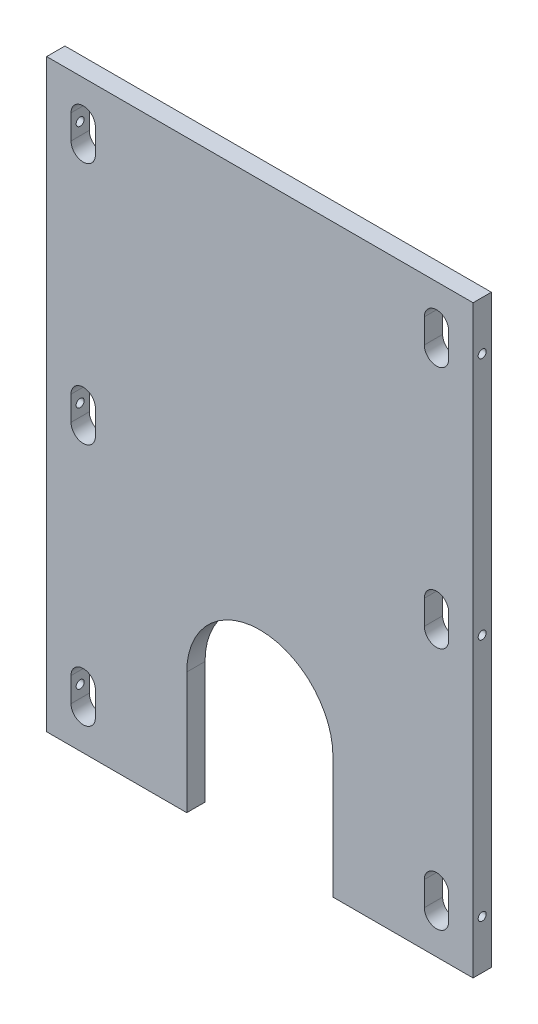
ISO-10303-21;
HEADER;
FILE_DESCRIPTION(('STEP AP214'),'2;1');
FILE_NAME('part.step','',(''),(''),'','','');
FILE_SCHEMA(('AUTOMOTIVE_DESIGN { 1 0 10303 214 1 1 1 1 }'));
ENDSEC;
DATA;
#1=APPLICATION_CONTEXT('core data for automotive mechanical design processes');
#2=APPLICATION_PROTOCOL_DEFINITION('international standard','automotive_design',2000,#1);
#3=PRODUCT_CONTEXT('',#1,'mechanical');
#4=PRODUCT('Part','Part','',(#3));
#5=PRODUCT_RELATED_PRODUCT_CATEGORY('part','',(#4));
#6=PRODUCT_DEFINITION_FORMATION('','',#4);
#7=PRODUCT_DEFINITION_CONTEXT('part definition',#1,'design');
#8=PRODUCT_DEFINITION('design','',#6,#7);
#9=PRODUCT_DEFINITION_SHAPE('','',#8);
#10=(LENGTH_UNIT() NAMED_UNIT(*) SI_UNIT(.MILLI.,.METRE.));
#11=(NAMED_UNIT(*) PLANE_ANGLE_UNIT() SI_UNIT($,.RADIAN.));
#12=(NAMED_UNIT(*) SI_UNIT($,.STERADIAN.) SOLID_ANGLE_UNIT());
#13=UNCERTAINTY_MEASURE_WITH_UNIT(LENGTH_MEASURE(1.E-05),#10,'distance_accuracy_value','');
#14=(GEOMETRIC_REPRESENTATION_CONTEXT(3) GLOBAL_UNCERTAINTY_ASSIGNED_CONTEXT((#13)) GLOBAL_UNIT_ASSIGNED_CONTEXT((#10,
#11,#12)) REPRESENTATION_CONTEXT('',''));
#15=CARTESIAN_POINT('',(0.,0.,0.));
#16=DIRECTION('',(0.,0.,1.));
#17=DIRECTION('',(1.,0.,0.));
#18=AXIS2_PLACEMENT_3D('',#15,#16,#17);
#19=CARTESIAN_POINT('',(-222.25,-304.8,9.525));
#20=DIRECTION('',(0.,1.,0.));
#21=DIRECTION('',(0.,0.,1.));
#22=AXIS2_PLACEMENT_3D('',#19,#20,#21);
#23=PLANE('',#22);
#24=DIRECTION('',(1.,0.,0.));
#25=VECTOR('',#24,1.);
#26=CARTESIAN_POINT('',(-222.25,-304.8,9.525));
#27=LINE('',#26,#25);
#28=CARTESIAN_POINT('',(76.2,-304.8,9.525));
#29=VERTEX_POINT('',#28);
#30=CARTESIAN_POINT('',(222.25,-304.8,9.525));
#31=VERTEX_POINT('',#30);
#32=EDGE_CURVE('E484',#29,#31,#27,.T.);
#33=ORIENTED_EDGE('',*,*,#32,.F.);
#34=DIRECTION('',(0.,0.,1.));
#35=VECTOR('',#34,1.);
#36=CARTESIAN_POINT('',(76.2,-304.8,-9.525));
#37=LINE('',#36,#35);
#38=CARTESIAN_POINT('',(76.2,-304.8,-9.525));
#39=VERTEX_POINT('',#38);
#40=EDGE_CURVE('E280',#39,#29,#37,.T.);
#41=ORIENTED_EDGE('',*,*,#40,.F.);
#42=DIRECTION('',(1.,0.,0.));
#43=VECTOR('',#42,1.);
#44=CARTESIAN_POINT('',(-222.25,-304.8,-9.525));
#45=LINE('',#44,#43);
#46=CARTESIAN_POINT('',(222.25,-304.8,-9.525));
#47=VERTEX_POINT('',#46);
#48=EDGE_CURVE('E474',#39,#47,#45,.T.);
#49=ORIENTED_EDGE('',*,*,#48,.T.);
#50=DIRECTION('',(0.,0.,-1.));
#51=VECTOR('',#50,1.);
#52=CARTESIAN_POINT('',(222.25,-304.8,9.525));
#53=LINE('',#52,#51);
#54=EDGE_CURVE('E496',#31,#47,#53,.T.);
#55=ORIENTED_EDGE('',*,*,#54,.F.);
#56=EDGE_LOOP('',(#33,#41,#49,#55));
#57=FACE_BOUND('',#56,.T.);
#58=ADVANCED_FACE('F36',(#57),#23,.F.);
#59=CARTESIAN_POINT('',(222.25,-304.8,9.525));
#60=DIRECTION('',(-1.,0.,0.));
#61=DIRECTION('',(0.,0.,1.));
#62=AXIS2_PLACEMENT_3D('',#59,#60,#61);
#63=PLANE('',#62);
#64=CARTESIAN_POINT('',(222.25,0.,0.));
#65=DIRECTION('',(-1.,0.,0.));
#66=DIRECTION('',(0.,0.,1.));
#67=AXIS2_PLACEMENT_3D('',#64,#65,#66);
#68=CIRCLE('',#67,4.191);
#69=CARTESIAN_POINT('',(222.25,0.,4.191));
#70=VERTEX_POINT('',#69);
#71=EDGE_CURVE('E288',#70,#70,#68,.T.);
#72=ORIENTED_EDGE('',*,*,#71,.T.);
#73=EDGE_LOOP('',(#72));
#74=FACE_BOUND('',#73,.T.);
#75=DIRECTION('',(0.,1.,0.));
#76=VECTOR('',#75,1.);
#77=CARTESIAN_POINT('',(222.25,-304.8,-9.525));
#78=LINE('',#77,#76);
#79=CARTESIAN_POINT('',(222.25,304.8,-9.525));
#80=VERTEX_POINT('',#79);
#81=EDGE_CURVE('E478',#47,#80,#78,.T.);
#82=ORIENTED_EDGE('',*,*,#81,.T.);
#83=DIRECTION('',(0.,0.,-1.));
#84=VECTOR('',#83,1.);
#85=CARTESIAN_POINT('',(222.25,304.8,9.525));
#86=LINE('',#85,#84);
#87=CARTESIAN_POINT('',(222.25,304.8,9.525));
#88=VERTEX_POINT('',#87);
#89=EDGE_CURVE('E493',#88,#80,#86,.T.);
#90=ORIENTED_EDGE('',*,*,#89,.F.);
#91=DIRECTION('',(0.,1.,0.));
#92=VECTOR('',#91,1.);
#93=CARTESIAN_POINT('',(222.25,-304.8,9.525));
#94=LINE('',#93,#92);
#95=EDGE_CURVE('E486',#31,#88,#94,.T.);
#96=ORIENTED_EDGE('',*,*,#95,.F.);
#97=ORIENTED_EDGE('',*,*,#54,.T.);
#98=EDGE_LOOP('',(#82,#90,#96,#97));
#99=FACE_BOUND('',#98,.T.);
#100=CARTESIAN_POINT('',(222.25,254.,0.));
#101=DIRECTION('',(-1.,0.,0.));
#102=DIRECTION('',(0.,0.,1.));
#103=AXIS2_PLACEMENT_3D('',#100,#101,#102);
#104=CIRCLE('',#103,4.191);
#105=CARTESIAN_POINT('',(222.25,254.,4.191));
#106=VERTEX_POINT('',#105);
#107=EDGE_CURVE('E306',#106,#106,#104,.T.);
#108=ORIENTED_EDGE('',*,*,#107,.T.);
#109=EDGE_LOOP('',(#108));
#110=FACE_BOUND('',#109,.T.);
#111=CARTESIAN_POINT('',(222.25,-254.,0.));
#112=DIRECTION('',(-1.,0.,0.));
#113=DIRECTION('',(0.,0.,1.));
#114=AXIS2_PLACEMENT_3D('',#111,#112,#113);
#115=CIRCLE('',#114,4.191);
#116=CARTESIAN_POINT('',(222.25,-254.,4.191));
#117=VERTEX_POINT('',#116);
#118=EDGE_CURVE('E279',#117,#117,#115,.T.);
#119=ORIENTED_EDGE('',*,*,#118,.T.);
#120=EDGE_LOOP('',(#119));
#121=FACE_BOUND('',#120,.T.);
#122=ADVANCED_FACE('F589',(#74,#99,#110,#121),#63,.F.);
#123=CARTESIAN_POINT('',(196.85,-266.7,-9.525));
#124=DIRECTION('',(-1.,0.,0.));
#125=DIRECTION('',(0.,0.,1.));
#126=AXIS2_PLACEMENT_3D('',#123,#124,#125);
#127=PLANE('',#126);
#128=DIRECTION('',(0.,-1.,0.));
#129=VECTOR('',#128,1.);
#130=CARTESIAN_POINT('',(196.85,-266.7,9.525));
#131=LINE('',#130,#129);
#132=CARTESIAN_POINT('',(196.85,-241.3,9.525));
#133=VERTEX_POINT('',#132);
#134=CARTESIAN_POINT('',(196.85,-266.7,9.525));
#135=VERTEX_POINT('',#134);
#136=EDGE_CURVE('E325',#133,#135,#131,.T.);
#137=ORIENTED_EDGE('',*,*,#136,.F.);
#138=DIRECTION('',(0.,0.,1.));
#139=VECTOR('',#138,1.);
#140=CARTESIAN_POINT('',(196.85,-241.3,-9.525));
#141=LINE('',#140,#139);
#142=CARTESIAN_POINT('',(196.85,-241.3,-9.525));
#143=VERTEX_POINT('',#142);
#144=EDGE_CURVE('E338',#143,#133,#141,.T.);
#145=ORIENTED_EDGE('',*,*,#144,.F.);
#146=DIRECTION('',(0.,-1.,0.));
#147=VECTOR('',#146,1.);
#148=CARTESIAN_POINT('',(196.85,-266.7,-9.525));
#149=LINE('',#148,#147);
#150=CARTESIAN_POINT('',(196.85,-266.7,-9.525));
#151=VERTEX_POINT('',#150);
#152=EDGE_CURVE('E335',#143,#151,#149,.T.);
#153=ORIENTED_EDGE('',*,*,#152,.T.);
#154=DIRECTION('',(0.,0.,1.));
#155=VECTOR('',#154,1.);
#156=CARTESIAN_POINT('',(196.85,-266.7,-9.525));
#157=LINE('',#156,#155);
#158=EDGE_CURVE('E341',#151,#135,#157,.T.);
#159=ORIENTED_EDGE('',*,*,#158,.T.);
#160=EDGE_LOOP('',(#137,#145,#153,#159));
#161=FACE_BOUND('',#160,.T.);
#162=CARTESIAN_POINT('',(196.85,-254.,0.));
#163=DIRECTION('',(-1.,0.,0.));
#164=DIRECTION('',(0.,0.,1.));
#165=AXIS2_PLACEMENT_3D('',#162,#163,#164);
#166=CIRCLE('',#165,4.191);
#167=CARTESIAN_POINT('',(196.85,-254.,4.191));
#168=VERTEX_POINT('',#167);
#169=EDGE_CURVE('E285',#168,#168,#166,.T.);
#170=ORIENTED_EDGE('',*,*,#169,.F.);
#171=EDGE_LOOP('',(#170));
#172=FACE_BOUND('',#171,.T.);
#173=ADVANCED_FACE('F566',(#161,#172),#127,.T.);
#174=CARTESIAN_POINT('',(196.85,-12.7,-9.525));
#175=DIRECTION('',(-1.,0.,0.));
#176=DIRECTION('',(0.,0.,1.));
#177=AXIS2_PLACEMENT_3D('',#174,#175,#176);
#178=PLANE('',#177);
#179=DIRECTION('',(0.,-1.,0.));
#180=VECTOR('',#179,1.);
#181=CARTESIAN_POINT('',(196.85,-12.7,9.525));
#182=LINE('',#181,#180);
#183=CARTESIAN_POINT('',(196.85,12.7,9.525));
#184=VERTEX_POINT('',#183);
#185=CARTESIAN_POINT('',(196.85,-12.7,9.525));
#186=VERTEX_POINT('',#185);
#187=EDGE_CURVE('E354',#184,#186,#182,.T.);
#188=ORIENTED_EDGE('',*,*,#187,.F.);
#189=DIRECTION('',(0.,0.,1.));
#190=VECTOR('',#189,1.);
#191=CARTESIAN_POINT('',(196.85,12.7,-9.525));
#192=LINE('',#191,#190);
#193=CARTESIAN_POINT('',(196.85,12.7,-9.525));
#194=VERTEX_POINT('',#193);
#195=EDGE_CURVE('E367',#194,#184,#192,.T.);
#196=ORIENTED_EDGE('',*,*,#195,.F.);
#197=DIRECTION('',(0.,-1.,0.));
#198=VECTOR('',#197,1.);
#199=CARTESIAN_POINT('',(196.85,-12.7,-9.525));
#200=LINE('',#199,#198);
#201=CARTESIAN_POINT('',(196.85,-12.7,-9.525));
#202=VERTEX_POINT('',#201);
#203=EDGE_CURVE('E364',#194,#202,#200,.T.);
#204=ORIENTED_EDGE('',*,*,#203,.T.);
#205=DIRECTION('',(0.,0.,1.));
#206=VECTOR('',#205,1.);
#207=CARTESIAN_POINT('',(196.85,-12.7,-9.525));
#208=LINE('',#207,#206);
#209=EDGE_CURVE('E371',#202,#186,#208,.T.);
#210=ORIENTED_EDGE('',*,*,#209,.T.);
#211=EDGE_LOOP('',(#188,#196,#204,#210));
#212=FACE_BOUND('',#211,.T.);
#213=CARTESIAN_POINT('',(196.85,0.,0.));
#214=DIRECTION('',(-1.,0.,0.));
#215=DIRECTION('',(0.,0.,1.));
#216=AXIS2_PLACEMENT_3D('',#213,#214,#215);
#217=CIRCLE('',#216,4.191);
#218=CARTESIAN_POINT('',(196.85,0.,4.191));
#219=VERTEX_POINT('',#218);
#220=EDGE_CURVE('E291',#219,#219,#217,.T.);
#221=ORIENTED_EDGE('',*,*,#220,.F.);
#222=EDGE_LOOP('',(#221));
#223=FACE_BOUND('',#222,.T.);
#224=ADVANCED_FACE('F659',(#212,#223),#178,.T.);
#225=CARTESIAN_POINT('',(196.85,241.3,-9.525));
#226=DIRECTION('',(-1.,0.,0.));
#227=DIRECTION('',(0.,0.,1.));
#228=AXIS2_PLACEMENT_3D('',#225,#226,#227);
#229=PLANE('',#228);
#230=DIRECTION('',(0.,-1.,0.));
#231=VECTOR('',#230,1.);
#232=CARTESIAN_POINT('',(196.85,241.3,9.525));
#233=LINE('',#232,#231);
#234=CARTESIAN_POINT('',(196.85,266.7,9.525));
#235=VERTEX_POINT('',#234);
#236=CARTESIAN_POINT('',(196.85,241.3,9.525));
#237=VERTEX_POINT('',#236);
#238=EDGE_CURVE('E385',#235,#237,#233,.T.);
#239=ORIENTED_EDGE('',*,*,#238,.F.);
#240=DIRECTION('',(0.,0.,1.));
#241=VECTOR('',#240,1.);
#242=CARTESIAN_POINT('',(196.85,266.7,-9.525));
#243=LINE('',#242,#241);
#244=CARTESIAN_POINT('',(196.85,266.7,-9.525));
#245=VERTEX_POINT('',#244);
#246=EDGE_CURVE('E398',#245,#235,#243,.T.);
#247=ORIENTED_EDGE('',*,*,#246,.F.);
#248=DIRECTION('',(0.,-1.,0.));
#249=VECTOR('',#248,1.);
#250=CARTESIAN_POINT('',(196.85,241.3,-9.525));
#251=LINE('',#250,#249);
#252=CARTESIAN_POINT('',(196.85,241.3,-9.525));
#253=VERTEX_POINT('',#252);
#254=EDGE_CURVE('E395',#245,#253,#251,.T.);
#255=ORIENTED_EDGE('',*,*,#254,.T.);
#256=DIRECTION('',(0.,0.,1.));
#257=VECTOR('',#256,1.);
#258=CARTESIAN_POINT('',(196.85,241.3,-9.525));
#259=LINE('',#258,#257);
#260=EDGE_CURVE('E402',#253,#237,#259,.T.);
#261=ORIENTED_EDGE('',*,*,#260,.T.);
#262=EDGE_LOOP('',(#239,#247,#255,#261));
#263=FACE_BOUND('',#262,.T.);
#264=CARTESIAN_POINT('',(196.85,254.,0.));
#265=DIRECTION('',(-1.,0.,0.));
#266=DIRECTION('',(0.,0.,1.));
#267=AXIS2_PLACEMENT_3D('',#264,#265,#266);
#268=CIRCLE('',#267,4.191);
#269=CARTESIAN_POINT('',(196.85,254.,4.191));
#270=VERTEX_POINT('',#269);
#271=EDGE_CURVE('E309',#270,#270,#268,.T.);
#272=ORIENTED_EDGE('',*,*,#271,.F.);
#273=EDGE_LOOP('',(#272));
#274=FACE_BOUND('',#273,.T.);
#275=ADVANCED_FACE('F663',(#263,#274),#229,.T.);
#276=CARTESIAN_POINT('',(-222.25,304.8,9.525));
#277=DIRECTION('',(0.,0.,-1.));
#278=DIRECTION('',(-1.,0.,0.));
#279=AXIS2_PLACEMENT_3D('',#276,#277,#278);
#280=PLANE('',#279);
#281=CARTESIAN_POINT('',(184.15,12.7,9.525));
#282=DIRECTION('',(0.,0.,-1.));
#283=DIRECTION('',(-1.,0.,0.));
#284=AXIS2_PLACEMENT_3D('',#281,#282,#283);
#285=CIRCLE('',#284,12.7);
#286=CARTESIAN_POINT('',(171.45,12.7,9.525));
#287=VERTEX_POINT('',#286);
#288=EDGE_CURVE('E340',#287,#184,#285,.T.);
#289=ORIENTED_EDGE('',*,*,#288,.T.);
#290=ORIENTED_EDGE('',*,*,#187,.T.);
#291=CARTESIAN_POINT('',(184.15,-12.7,9.525));
#292=DIRECTION('',(0.,0.,-1.));
#293=DIRECTION('',(-1.,0.,0.));
#294=AXIS2_PLACEMENT_3D('',#291,#292,#293);
#295=CIRCLE('',#294,12.7);
#296=CARTESIAN_POINT('',(171.45,-12.7,9.525));
#297=VERTEX_POINT('',#296);
#298=EDGE_CURVE('E351',#186,#297,#295,.T.);
#299=ORIENTED_EDGE('',*,*,#298,.T.);
#300=DIRECTION('',(0.,1.,0.));
#301=VECTOR('',#300,1.);
#302=CARTESIAN_POINT('',(171.45,12.7,9.525));
#303=LINE('',#302,#301);
#304=EDGE_CURVE('E348',#297,#287,#303,.T.);
#305=ORIENTED_EDGE('',*,*,#304,.T.);
#306=EDGE_LOOP('',(#289,#290,#299,#305));
#307=FACE_BOUND('',#306,.T.);
#308=CARTESIAN_POINT('',(-184.15,-241.3,9.525));
#309=DIRECTION('',(0.,0.,1.));
#310=DIRECTION('',(1.,0.,0.));
#311=AXIS2_PLACEMENT_3D('',#308,#309,#310);
#312=CIRCLE('',#311,12.7);
#313=CARTESIAN_POINT('',(-171.45,-241.3,9.525));
#314=VERTEX_POINT('',#313);
#315=CARTESIAN_POINT('',(-196.85,-241.3,9.525));
#316=VERTEX_POINT('',#315);
#317=EDGE_CURVE('E502',#314,#316,#312,.T.);
#318=ORIENTED_EDGE('',*,*,#317,.F.);
#319=DIRECTION('',(0.,1.,0.));
#320=VECTOR('',#319,1.);
#321=CARTESIAN_POINT('',(-171.45,-241.3,9.525));
#322=LINE('',#321,#320);
#323=CARTESIAN_POINT('',(-171.45,-266.7,9.525));
#324=VERTEX_POINT('',#323);
#325=EDGE_CURVE('E504',#324,#314,#322,.T.);
#326=ORIENTED_EDGE('',*,*,#325,.F.);
#327=CARTESIAN_POINT('',(-184.15,-266.7,9.525));
#328=DIRECTION('',(0.,0.,1.));
#329=DIRECTION('',(1.,0.,0.));
#330=AXIS2_PLACEMENT_3D('',#327,#328,#329);
#331=CIRCLE('',#330,12.7);
#332=CARTESIAN_POINT('',(-196.85,-266.7,9.525));
#333=VERTEX_POINT('',#332);
#334=EDGE_CURVE('E507',#333,#324,#331,.T.);
#335=ORIENTED_EDGE('',*,*,#334,.F.);
#336=DIRECTION('',(0.,-1.,0.));
#337=VECTOR('',#336,1.);
#338=CARTESIAN_POINT('',(-196.85,-266.7,9.525));
#339=LINE('',#338,#337);
#340=EDGE_CURVE('E510',#316,#333,#339,.T.);
#341=ORIENTED_EDGE('',*,*,#340,.F.);
#342=EDGE_LOOP('',(#318,#326,#335,#341));
#343=FACE_BOUND('',#342,.T.);
#344=CARTESIAN_POINT('',(0.,-177.8,9.525));
#345=DIRECTION('',(0.,0.,1.));
#346=DIRECTION('',(1.,0.,0.));
#347=AXIS2_PLACEMENT_3D('',#344,#345,#346);
#348=CIRCLE('',#347,76.2);
#349=CARTESIAN_POINT('',(76.2,-177.8,9.525));
#350=VERTEX_POINT('',#349);
#351=CARTESIAN_POINT('',(-76.2,-177.8,9.525));
#352=VERTEX_POINT('',#351);
#353=EDGE_CURVE('E257',#350,#352,#348,.T.);
#354=ORIENTED_EDGE('',*,*,#353,.F.);
#355=DIRECTION('',(0.,1.,0.));
#356=VECTOR('',#355,1.);
#357=CARTESIAN_POINT('',(76.2,-177.8,9.525));
#358=LINE('',#357,#356);
#359=EDGE_CURVE('E269',#29,#350,#358,.T.);
#360=ORIENTED_EDGE('',*,*,#359,.F.);
#361=ORIENTED_EDGE('',*,*,#32,.T.);
#362=ORIENTED_EDGE('',*,*,#95,.T.);
#363=DIRECTION('',(-1.,0.,0.));
#364=VECTOR('',#363,1.);
#365=CARTESIAN_POINT('',(-222.25,304.8,9.525));
#366=LINE('',#365,#364);
#367=CARTESIAN_POINT('',(-222.25,304.8,9.525));
#368=VERTEX_POINT('',#367);
#369=EDGE_CURVE('E488',#88,#368,#366,.T.);
#370=ORIENTED_EDGE('',*,*,#369,.T.);
#371=DIRECTION('',(0.,-1.,0.));
#372=VECTOR('',#371,1.);
#373=CARTESIAN_POINT('',(-222.25,-304.8,9.525));
#374=LINE('',#373,#372);
#375=CARTESIAN_POINT('',(-222.25,-304.8,9.525));
#376=VERTEX_POINT('',#375);
#377=EDGE_CURVE('E482',#368,#376,#374,.T.);
#378=ORIENTED_EDGE('',*,*,#377,.T.);
#379=CARTESIAN_POINT('',(-76.2,-304.8,9.525));
#380=VERTEX_POINT('',#379);
#381=EDGE_CURVE('E268',#376,#380,#27,.T.);
#382=ORIENTED_EDGE('',*,*,#381,.T.);
#383=DIRECTION('',(0.,-1.,0.));
#384=VECTOR('',#383,1.);
#385=CARTESIAN_POINT('',(-76.2,-177.8,9.525));
#386=LINE('',#385,#384);
#387=EDGE_CURVE('E51',#352,#380,#386,.T.);
#388=ORIENTED_EDGE('',*,*,#387,.F.);
#389=EDGE_LOOP('',(#354,#360,#361,#362,#370,#378,#382,#388));
#390=FACE_BOUND('',#389,.T.);
#391=DIRECTION('',(0.,-1.,0.));
#392=VECTOR('',#391,1.);
#393=CARTESIAN_POINT('',(-196.85,241.3,9.525));
#394=LINE('',#393,#392);
#395=CARTESIAN_POINT('',(-196.85,266.7,9.525));
#396=VERTEX_POINT('',#395);
#397=CARTESIAN_POINT('',(-196.85,241.3,9.525));
#398=VERTEX_POINT('',#397);
#399=EDGE_CURVE('E441',#396,#398,#394,.T.);
#400=ORIENTED_EDGE('',*,*,#399,.F.);
#401=CARTESIAN_POINT('',(-184.15,266.7,9.525));
#402=DIRECTION('',(0.,0.,1.));
#403=DIRECTION('',(1.,0.,0.));
#404=AXIS2_PLACEMENT_3D('',#401,#402,#403);
#405=CIRCLE('',#404,12.7);
#406=CARTESIAN_POINT('',(-171.45,266.7,9.525));
#407=VERTEX_POINT('',#406);
#408=EDGE_CURVE('E439',#407,#396,#405,.T.);
#409=ORIENTED_EDGE('',*,*,#408,.F.);
#410=DIRECTION('',(0.,1.,0.));
#411=VECTOR('',#410,1.);
#412=CARTESIAN_POINT('',(-171.45,266.7,9.525));
#413=LINE('',#412,#411);
#414=CARTESIAN_POINT('',(-171.45,241.3,9.525));
#415=VERTEX_POINT('',#414);
#416=EDGE_CURVE('E447',#415,#407,#413,.T.);
#417=ORIENTED_EDGE('',*,*,#416,.F.);
#418=CARTESIAN_POINT('',(-184.15,241.3,9.525));
#419=DIRECTION('',(0.,0.,1.));
#420=DIRECTION('',(1.,0.,0.));
#421=AXIS2_PLACEMENT_3D('',#418,#419,#420);
#422=CIRCLE('',#421,12.7);
#423=EDGE_CURVE('E444',#398,#415,#422,.T.);
#424=ORIENTED_EDGE('',*,*,#423,.F.);
#425=EDGE_LOOP('',(#400,#409,#417,#424));
#426=FACE_BOUND('',#425,.T.);
#427=DIRECTION('',(0.,-1.,0.));
#428=VECTOR('',#427,1.);
#429=CARTESIAN_POINT('',(-196.85,-12.7,9.525));
#430=LINE('',#429,#428);
#431=CARTESIAN_POINT('',(-196.85,12.7,9.525));
#432=VERTEX_POINT('',#431);
#433=CARTESIAN_POINT('',(-196.85,-12.7,9.525));
#434=VERTEX_POINT('',#433);
#435=EDGE_CURVE('E401',#432,#434,#430,.T.);
#436=ORIENTED_EDGE('',*,*,#435,.F.);
#437=CARTESIAN_POINT('',(-184.15,12.7,9.525));
#438=DIRECTION('',(0.,0.,1.));
#439=DIRECTION('',(1.,0.,0.));
#440=AXIS2_PLACEMENT_3D('',#437,#438,#439);
#441=CIRCLE('',#440,12.7);
#442=CARTESIAN_POINT('',(-171.45,12.7,9.525));
#443=VERTEX_POINT('',#442);
#444=EDGE_CURVE('E434',#443,#432,#441,.T.);
#445=ORIENTED_EDGE('',*,*,#444,.F.);
#446=DIRECTION('',(0.,1.,0.));
#447=VECTOR('',#446,1.);
#448=CARTESIAN_POINT('',(-171.45,12.7,9.525));
#449=LINE('',#448,#447);
#450=CARTESIAN_POINT('',(-171.45,-12.7,9.525));
#451=VERTEX_POINT('',#450);
#452=EDGE_CURVE('E426',#451,#443,#449,.T.);
#453=ORIENTED_EDGE('',*,*,#452,.F.);
#454=CARTESIAN_POINT('',(-184.15,-12.7,9.525));
#455=DIRECTION('',(0.,0.,1.));
#456=DIRECTION('',(1.,0.,0.));
#457=AXIS2_PLACEMENT_3D('',#454,#455,#456);
#458=CIRCLE('',#457,12.7);
#459=EDGE_CURVE('E418',#434,#451,#458,.T.);
#460=ORIENTED_EDGE('',*,*,#459,.F.);
#461=EDGE_LOOP('',(#436,#445,#453,#460));
#462=FACE_BOUND('',#461,.T.);
#463=CARTESIAN_POINT('',(184.15,266.7,9.525));
#464=DIRECTION('',(0.,0.,-1.));
#465=DIRECTION('',(-1.,0.,0.));
#466=AXIS2_PLACEMENT_3D('',#463,#464,#465);
#467=CIRCLE('',#466,12.7);
#468=CARTESIAN_POINT('',(171.45,266.7,9.525));
#469=VERTEX_POINT('',#468);
#470=EDGE_CURVE('E370',#469,#235,#467,.T.);
#471=ORIENTED_EDGE('',*,*,#470,.T.);
#472=ORIENTED_EDGE('',*,*,#238,.T.);
#473=CARTESIAN_POINT('',(184.15,241.3,9.525));
#474=DIRECTION('',(0.,0.,-1.));
#475=DIRECTION('',(-1.,0.,0.));
#476=AXIS2_PLACEMENT_3D('',#473,#474,#475);
#477=CIRCLE('',#476,12.7);
#478=CARTESIAN_POINT('',(171.45,241.3,9.525));
#479=VERTEX_POINT('',#478);
#480=EDGE_CURVE('E382',#237,#479,#477,.T.);
#481=ORIENTED_EDGE('',*,*,#480,.T.);
#482=DIRECTION('',(0.,1.,0.));
#483=VECTOR('',#482,1.);
#484=CARTESIAN_POINT('',(171.45,266.7,9.525));
#485=LINE('',#484,#483);
#486=EDGE_CURVE('E379',#479,#469,#485,.T.);
#487=ORIENTED_EDGE('',*,*,#486,.T.);
#488=EDGE_LOOP('',(#471,#472,#481,#487));
#489=FACE_BOUND('',#488,.T.);
#490=CARTESIAN_POINT('',(184.15,-241.3,9.525));
#491=DIRECTION('',(0.,0.,-1.));
#492=DIRECTION('',(-1.,0.,0.));
#493=AXIS2_PLACEMENT_3D('',#490,#491,#492);
#494=CIRCLE('',#493,12.7);
#495=CARTESIAN_POINT('',(171.45,-241.3,9.525));
#496=VERTEX_POINT('',#495);
#497=EDGE_CURVE('E59',#496,#133,#494,.T.);
#498=ORIENTED_EDGE('',*,*,#497,.T.);
#499=ORIENTED_EDGE('',*,*,#136,.T.);
#500=CARTESIAN_POINT('',(184.15,-266.7,9.525));
#501=DIRECTION('',(0.,0.,-1.));
#502=DIRECTION('',(-1.,0.,0.));
#503=AXIS2_PLACEMENT_3D('',#500,#501,#502);
#504=CIRCLE('',#503,12.7);
#505=CARTESIAN_POINT('',(171.45,-266.7,9.525));
#506=VERTEX_POINT('',#505);
#507=EDGE_CURVE('E322',#135,#506,#504,.T.);
#508=ORIENTED_EDGE('',*,*,#507,.T.);
#509=DIRECTION('',(0.,1.,0.));
#510=VECTOR('',#509,1.);
#511=CARTESIAN_POINT('',(171.45,-241.3,9.525));
#512=LINE('',#511,#510);
#513=EDGE_CURVE('E319',#506,#496,#512,.T.);
#514=ORIENTED_EDGE('',*,*,#513,.T.);
#515=EDGE_LOOP('',(#498,#499,#508,#514));
#516=FACE_BOUND('',#515,.T.);
#517=ADVANCED_FACE('F265',(#307,#343,#390,#426,#462,#489,#516),#280,.F.);
#518=CARTESIAN_POINT('',(-222.25,304.8,-9.525));
#519=DIRECTION('',(0.,0.,-1.));
#520=DIRECTION('',(-1.,0.,0.));
#521=AXIS2_PLACEMENT_3D('',#518,#519,#520);
#522=PLANE('',#521);
#523=DIRECTION('',(0.,1.,0.));
#524=VECTOR('',#523,1.);
#525=CARTESIAN_POINT('',(76.2,-177.8,-9.525));
#526=LINE('',#525,#524);
#527=CARTESIAN_POINT('',(76.2,-177.8,-9.525));
#528=VERTEX_POINT('',#527);
#529=EDGE_CURVE('E254',#39,#528,#526,.T.);
#530=ORIENTED_EDGE('',*,*,#529,.T.);
#531=CARTESIAN_POINT('',(0.,-177.8,-9.525));
#532=DIRECTION('',(0.,0.,1.));
#533=DIRECTION('',(1.,0.,0.));
#534=AXIS2_PLACEMENT_3D('',#531,#532,#533);
#535=CIRCLE('',#534,76.2);
#536=CARTESIAN_POINT('',(-76.2,-177.8,-9.525));
#537=VERTEX_POINT('',#536);
#538=EDGE_CURVE('E271',#528,#537,#535,.T.);
#539=ORIENTED_EDGE('',*,*,#538,.T.);
#540=DIRECTION('',(0.,-1.,0.));
#541=VECTOR('',#540,1.);
#542=CARTESIAN_POINT('',(-76.2,-177.8,-9.525));
#543=LINE('',#542,#541);
#544=CARTESIAN_POINT('',(-76.2,-304.8,-9.525));
#545=VERTEX_POINT('',#544);
#546=EDGE_CURVE('E249',#537,#545,#543,.T.);
#547=ORIENTED_EDGE('',*,*,#546,.T.);
#548=CARTESIAN_POINT('',(-222.25,-304.8,-9.525));
#549=VERTEX_POINT('',#548);
#550=EDGE_CURVE('E475',#549,#545,#45,.T.);
#551=ORIENTED_EDGE('',*,*,#550,.F.);
#552=DIRECTION('',(0.,-1.,0.));
#553=VECTOR('',#552,1.);
#554=CARTESIAN_POINT('',(-222.25,-304.8,-9.525));
#555=LINE('',#554,#553);
#556=CARTESIAN_POINT('',(-222.25,304.8,-9.525));
#557=VERTEX_POINT('',#556);
#558=EDGE_CURVE('E465',#557,#549,#555,.T.);
#559=ORIENTED_EDGE('',*,*,#558,.F.);
#560=DIRECTION('',(-1.,0.,0.));
#561=VECTOR('',#560,1.);
#562=CARTESIAN_POINT('',(-222.25,304.8,-9.525));
#563=LINE('',#562,#561);
#564=EDGE_CURVE('E480',#80,#557,#563,.T.);
#565=ORIENTED_EDGE('',*,*,#564,.F.);
#566=ORIENTED_EDGE('',*,*,#81,.F.);
#567=ORIENTED_EDGE('',*,*,#48,.F.);
#568=EDGE_LOOP('',(#530,#539,#547,#551,#559,#565,#566,#567));
#569=FACE_BOUND('',#568,.T.);
#570=ORIENTED_EDGE('',*,*,#203,.F.);
#571=CARTESIAN_POINT('',(184.15,12.7,-9.525));
#572=DIRECTION('',(0.,0.,-1.));
#573=DIRECTION('',(-1.,0.,0.));
#574=AXIS2_PLACEMENT_3D('',#571,#572,#573);
#575=CIRCLE('',#574,12.7);
#576=CARTESIAN_POINT('',(171.45,12.7,-9.525));
#577=VERTEX_POINT('',#576);
#578=EDGE_CURVE('E357',#577,#194,#575,.T.);
#579=ORIENTED_EDGE('',*,*,#578,.F.);
#580=DIRECTION('',(0.,1.,0.));
#581=VECTOR('',#580,1.);
#582=CARTESIAN_POINT('',(171.45,12.7,-9.525));
#583=LINE('',#582,#581);
#584=CARTESIAN_POINT('',(171.45,-12.7,-9.525));
#585=VERTEX_POINT('',#584);
#586=EDGE_CURVE('E359',#585,#577,#583,.T.);
#587=ORIENTED_EDGE('',*,*,#586,.F.);
#588=CARTESIAN_POINT('',(184.15,-12.7,-9.525));
#589=DIRECTION('',(0.,0.,-1.));
#590=DIRECTION('',(-1.,0.,0.));
#591=AXIS2_PLACEMENT_3D('',#588,#589,#590);
#592=CIRCLE('',#591,12.7);
#593=EDGE_CURVE('E361',#202,#585,#592,.T.);
#594=ORIENTED_EDGE('',*,*,#593,.F.);
#595=EDGE_LOOP('',(#570,#579,#587,#594));
#596=FACE_BOUND('',#595,.T.);
#597=CARTESIAN_POINT('',(-184.15,-241.3,-9.525));
#598=DIRECTION('',(0.,0.,1.));
#599=DIRECTION('',(1.,0.,0.));
#600=AXIS2_PLACEMENT_3D('',#597,#598,#599);
#601=CIRCLE('',#600,12.7);
#602=CARTESIAN_POINT('',(-171.45,-241.3,-9.525));
#603=VERTEX_POINT('',#602);
#604=CARTESIAN_POINT('',(-196.85,-241.3,-9.525));
#605=VERTEX_POINT('',#604);
#606=EDGE_CURVE('E513',#603,#605,#601,.T.);
#607=ORIENTED_EDGE('',*,*,#606,.T.);
#608=DIRECTION('',(0.,-1.,0.));
#609=VECTOR('',#608,1.);
#610=CARTESIAN_POINT('',(-196.85,-266.7,-9.525));
#611=LINE('',#610,#609);
#612=CARTESIAN_POINT('',(-196.85,-266.7,-9.525));
#613=VERTEX_POINT('',#612);
#614=EDGE_CURVE('E515',#605,#613,#611,.T.);
#615=ORIENTED_EDGE('',*,*,#614,.T.);
#616=CARTESIAN_POINT('',(-184.15,-266.7,-9.525));
#617=DIRECTION('',(0.,0.,1.));
#618=DIRECTION('',(1.,0.,0.));
#619=AXIS2_PLACEMENT_3D('',#616,#617,#618);
#620=CIRCLE('',#619,12.7);
#621=CARTESIAN_POINT('',(-171.45,-266.7,-9.525));
#622=VERTEX_POINT('',#621);
#623=EDGE_CURVE('E517',#613,#622,#620,.T.);
#624=ORIENTED_EDGE('',*,*,#623,.T.);
#625=DIRECTION('',(0.,1.,0.));
#626=VECTOR('',#625,1.);
#627=CARTESIAN_POINT('',(-171.45,-241.3,-9.525));
#628=LINE('',#627,#626);
#629=EDGE_CURVE('E519',#622,#603,#628,.T.);
#630=ORIENTED_EDGE('',*,*,#629,.T.);
#631=EDGE_LOOP('',(#607,#615,#624,#630));
#632=FACE_BOUND('',#631,.T.);
#633=CARTESIAN_POINT('',(-184.15,266.7,-9.525));
#634=DIRECTION('',(0.,0.,1.));
#635=DIRECTION('',(1.,0.,0.));
#636=AXIS2_PLACEMENT_3D('',#633,#634,#635);
#637=CIRCLE('',#636,12.7);
#638=CARTESIAN_POINT('',(-171.45,266.7,-9.525));
#639=VERTEX_POINT('',#638);
#640=CARTESIAN_POINT('',(-196.85,266.7,-9.525));
#641=VERTEX_POINT('',#640);
#642=EDGE_CURVE('E450',#639,#641,#637,.T.);
#643=ORIENTED_EDGE('',*,*,#642,.T.);
#644=DIRECTION('',(0.,-1.,0.));
#645=VECTOR('',#644,1.);
#646=CARTESIAN_POINT('',(-196.85,241.3,-9.525));
#647=LINE('',#646,#645);
#648=CARTESIAN_POINT('',(-196.85,241.3,-9.525));
#649=VERTEX_POINT('',#648);
#650=EDGE_CURVE('E453',#641,#649,#647,.T.);
#651=ORIENTED_EDGE('',*,*,#650,.T.);
#652=CARTESIAN_POINT('',(-184.15,241.3,-9.525));
#653=DIRECTION('',(0.,0.,1.));
#654=DIRECTION('',(1.,0.,0.));
#655=AXIS2_PLACEMENT_3D('',#652,#653,#654);
#656=CIRCLE('',#655,12.7);
#657=CARTESIAN_POINT('',(-171.45,241.3,-9.525));
#658=VERTEX_POINT('',#657);
#659=EDGE_CURVE('E456',#649,#658,#656,.T.);
#660=ORIENTED_EDGE('',*,*,#659,.T.);
#661=DIRECTION('',(0.,1.,0.));
#662=VECTOR('',#661,1.);
#663=CARTESIAN_POINT('',(-171.45,266.7,-9.525));
#664=LINE('',#663,#662);
#665=EDGE_CURVE('E459',#658,#639,#664,.T.);
#666=ORIENTED_EDGE('',*,*,#665,.T.);
#667=EDGE_LOOP('',(#643,#651,#660,#666));
#668=FACE_BOUND('',#667,.T.);
#669=CARTESIAN_POINT('',(-184.15,12.7,-9.525));
#670=DIRECTION('',(0.,0.,1.));
#671=DIRECTION('',(1.,0.,0.));
#672=AXIS2_PLACEMENT_3D('',#669,#670,#671);
#673=CIRCLE('',#672,12.7);
#674=CARTESIAN_POINT('',(-171.45,12.7,-9.525));
#675=VERTEX_POINT('',#674);
#676=CARTESIAN_POINT('',(-196.85,12.7,-9.525));
#677=VERTEX_POINT('',#676);
#678=EDGE_CURVE('E436',#675,#677,#673,.T.);
#679=ORIENTED_EDGE('',*,*,#678,.T.);
#680=DIRECTION('',(0.,-1.,0.));
#681=VECTOR('',#680,1.);
#682=CARTESIAN_POINT('',(-196.85,-12.7,-9.525));
#683=LINE('',#682,#681);
#684=CARTESIAN_POINT('',(-196.85,-12.7,-9.525));
#685=VERTEX_POINT('',#684);
#686=EDGE_CURVE('E409',#677,#685,#683,.T.);
#687=ORIENTED_EDGE('',*,*,#686,.T.);
#688=CARTESIAN_POINT('',(-184.15,-12.7,-9.525));
#689=DIRECTION('',(0.,0.,1.));
#690=DIRECTION('',(1.,0.,0.));
#691=AXIS2_PLACEMENT_3D('',#688,#689,#690);
#692=CIRCLE('',#691,12.7);
#693=CARTESIAN_POINT('',(-171.45,-12.7,-9.525));
#694=VERTEX_POINT('',#693);
#695=EDGE_CURVE('E423',#685,#694,#692,.T.);
#696=ORIENTED_EDGE('',*,*,#695,.T.);
#697=DIRECTION('',(0.,1.,0.));
#698=VECTOR('',#697,1.);
#699=CARTESIAN_POINT('',(-171.45,12.7,-9.525));
#700=LINE('',#699,#698);
#701=EDGE_CURVE('E431',#694,#675,#700,.T.);
#702=ORIENTED_EDGE('',*,*,#701,.T.);
#703=EDGE_LOOP('',(#679,#687,#696,#702));
#704=FACE_BOUND('',#703,.T.);
#705=ORIENTED_EDGE('',*,*,#254,.F.);
#706=CARTESIAN_POINT('',(184.15,266.7,-9.525));
#707=DIRECTION('',(0.,0.,-1.));
#708=DIRECTION('',(-1.,0.,0.));
#709=AXIS2_PLACEMENT_3D('',#706,#707,#708);
#710=CIRCLE('',#709,12.7);
#711=CARTESIAN_POINT('',(171.45,266.7,-9.525));
#712=VERTEX_POINT('',#711);
#713=EDGE_CURVE('E388',#712,#245,#710,.T.);
#714=ORIENTED_EDGE('',*,*,#713,.F.);
#715=DIRECTION('',(0.,1.,0.));
#716=VECTOR('',#715,1.);
#717=CARTESIAN_POINT('',(171.45,266.7,-9.525));
#718=LINE('',#717,#716);
#719=CARTESIAN_POINT('',(171.45,241.3,-9.525));
#720=VERTEX_POINT('',#719);
#721=EDGE_CURVE('E390',#720,#712,#718,.T.);
#722=ORIENTED_EDGE('',*,*,#721,.F.);
#723=CARTESIAN_POINT('',(184.15,241.3,-9.525));
#724=DIRECTION('',(0.,0.,-1.));
#725=DIRECTION('',(-1.,0.,0.));
#726=AXIS2_PLACEMENT_3D('',#723,#724,#725);
#727=CIRCLE('',#726,12.7);
#728=EDGE_CURVE('E392',#253,#720,#727,.T.);
#729=ORIENTED_EDGE('',*,*,#728,.F.);
#730=EDGE_LOOP('',(#705,#714,#722,#729));
#731=FACE_BOUND('',#730,.T.);
#732=ORIENTED_EDGE('',*,*,#152,.F.);
#733=CARTESIAN_POINT('',(184.15,-241.3,-9.525));
#734=DIRECTION('',(0.,0.,-1.));
#735=DIRECTION('',(-1.,0.,0.));
#736=AXIS2_PLACEMENT_3D('',#733,#734,#735);
#737=CIRCLE('',#736,12.7);
#738=CARTESIAN_POINT('',(171.45,-241.3,-9.525));
#739=VERTEX_POINT('',#738);
#740=EDGE_CURVE('E328',#739,#143,#737,.T.);
#741=ORIENTED_EDGE('',*,*,#740,.F.);
#742=DIRECTION('',(0.,1.,0.));
#743=VECTOR('',#742,1.);
#744=CARTESIAN_POINT('',(171.45,-241.3,-9.525));
#745=LINE('',#744,#743);
#746=CARTESIAN_POINT('',(171.45,-266.7,-9.525));
#747=VERTEX_POINT('',#746);
#748=EDGE_CURVE('E330',#747,#739,#745,.T.);
#749=ORIENTED_EDGE('',*,*,#748,.F.);
#750=CARTESIAN_POINT('',(184.15,-266.7,-9.525));
#751=DIRECTION('',(0.,0.,-1.));
#752=DIRECTION('',(-1.,0.,0.));
#753=AXIS2_PLACEMENT_3D('',#750,#751,#752);
#754=CIRCLE('',#753,12.7);
#755=EDGE_CURVE('E332',#151,#747,#754,.T.);
#756=ORIENTED_EDGE('',*,*,#755,.F.);
#757=EDGE_LOOP('',(#732,#741,#749,#756));
#758=FACE_BOUND('',#757,.T.);
#759=ADVANCED_FACE('F545',(#569,#596,#632,#668,#704,#731,#758),#522,.T.);
#760=CARTESIAN_POINT('',(-222.25,-304.8,9.525));
#761=DIRECTION('',(1.,0.,0.));
#762=DIRECTION('',(0.,0.,-1.));
#763=AXIS2_PLACEMENT_3D('',#760,#761,#762);
#764=PLANE('',#763);
#765=CARTESIAN_POINT('',(-222.25,-254.,0.));
#766=DIRECTION('',(-1.,0.,0.));
#767=DIRECTION('',(0.,0.,1.));
#768=AXIS2_PLACEMENT_3D('',#765,#766,#767);
#769=CIRCLE('',#768,4.191);
#770=CARTESIAN_POINT('',(-222.25,-254.,4.191));
#771=VERTEX_POINT('',#770);
#772=EDGE_CURVE('E294',#771,#771,#769,.T.);
#773=ORIENTED_EDGE('',*,*,#772,.F.);
#774=EDGE_LOOP('',(#773));
#775=FACE_BOUND('',#774,.T.);
#776=CARTESIAN_POINT('',(-222.25,0.,0.));
#777=DIRECTION('',(-1.,0.,0.));
#778=DIRECTION('',(0.,0.,1.));
#779=AXIS2_PLACEMENT_3D('',#776,#777,#778);
#780=CIRCLE('',#779,4.191);
#781=CARTESIAN_POINT('',(-222.25,0.,4.191));
#782=VERTEX_POINT('',#781);
#783=EDGE_CURVE('E300',#782,#782,#780,.T.);
#784=ORIENTED_EDGE('',*,*,#783,.F.);
#785=EDGE_LOOP('',(#784));
#786=FACE_BOUND('',#785,.T.);
#787=CARTESIAN_POINT('',(-222.25,254.,0.));
#788=DIRECTION('',(-1.,0.,0.));
#789=DIRECTION('',(0.,0.,1.));
#790=AXIS2_PLACEMENT_3D('',#787,#788,#789);
#791=CIRCLE('',#790,4.191);
#792=CARTESIAN_POINT('',(-222.25,254.,4.191));
#793=VERTEX_POINT('',#792);
#794=EDGE_CURVE('E312',#793,#793,#791,.T.);
#795=ORIENTED_EDGE('',*,*,#794,.F.);
#796=EDGE_LOOP('',(#795));
#797=FACE_BOUND('',#796,.T.);
#798=ORIENTED_EDGE('',*,*,#558,.T.);
#799=DIRECTION('',(0.,0.,-1.));
#800=VECTOR('',#799,1.);
#801=CARTESIAN_POINT('',(-222.25,-304.8,9.525));
#802=LINE('',#801,#800);
#803=EDGE_CURVE('E499',#376,#549,#802,.T.);
#804=ORIENTED_EDGE('',*,*,#803,.F.);
#805=ORIENTED_EDGE('',*,*,#377,.F.);
#806=DIRECTION('',(0.,0.,-1.));
#807=VECTOR('',#806,1.);
#808=CARTESIAN_POINT('',(-222.25,304.8,9.525));
#809=LINE('',#808,#807);
#810=EDGE_CURVE('E490',#368,#557,#809,.T.);
#811=ORIENTED_EDGE('',*,*,#810,.T.);
#812=EDGE_LOOP('',(#798,#804,#805,#811));
#813=FACE_BOUND('',#812,.T.);
#814=ADVANCED_FACE('F548',(#775,#786,#797,#813),#764,.F.);
#815=ORIENTED_EDGE('',*,*,#550,.T.);
#816=DIRECTION('',(0.,0.,1.));
#817=VECTOR('',#816,1.);
#818=CARTESIAN_POINT('',(-76.2,-304.8,-9.525));
#819=LINE('',#818,#817);
#820=EDGE_CURVE('E253',#545,#380,#819,.T.);
#821=ORIENTED_EDGE('',*,*,#820,.T.);
#822=ORIENTED_EDGE('',*,*,#381,.F.);
#823=ORIENTED_EDGE('',*,*,#803,.T.);
#824=EDGE_LOOP('',(#815,#821,#822,#823));
#825=FACE_BOUND('',#824,.T.);
#826=ADVANCED_FACE('F592',(#825),#23,.F.);
#827=CARTESIAN_POINT('',(-222.25,304.8,9.525));
#828=DIRECTION('',(0.,-1.,0.));
#829=DIRECTION('',(0.,0.,-1.));
#830=AXIS2_PLACEMENT_3D('',#827,#828,#829);
#831=PLANE('',#830);
#832=ORIENTED_EDGE('',*,*,#564,.T.);
#833=ORIENTED_EDGE('',*,*,#810,.F.);
#834=ORIENTED_EDGE('',*,*,#369,.F.);
#835=ORIENTED_EDGE('',*,*,#89,.T.);
#836=EDGE_LOOP('',(#832,#833,#834,#835));
#837=FACE_BOUND('',#836,.T.);
#838=ADVANCED_FACE('F601',(#837),#831,.F.);
#839=CARTESIAN_POINT('',(-184.15,266.7,-9.525));
#840=DIRECTION('',(0.,0.,1.));
#841=DIRECTION('',(1.,0.,0.));
#842=AXIS2_PLACEMENT_3D('',#839,#840,#841);
#843=CYLINDRICAL_SURFACE('',#842,12.7);
#844=ORIENTED_EDGE('',*,*,#408,.T.);
#845=DIRECTION('',(0.,0.,1.));
#846=VECTOR('',#845,1.);
#847=CARTESIAN_POINT('',(-196.85,266.7,-9.525));
#848=LINE('',#847,#846);
#849=EDGE_CURVE('E462',#641,#396,#848,.T.);
#850=ORIENTED_EDGE('',*,*,#849,.F.);
#851=ORIENTED_EDGE('',*,*,#642,.F.);
#852=DIRECTION('',(0.,0.,1.));
#853=VECTOR('',#852,1.);
#854=CARTESIAN_POINT('',(-171.45,266.7,-9.525));
#855=LINE('',#854,#853);
#856=EDGE_CURVE('E463',#639,#407,#855,.T.);
#857=ORIENTED_EDGE('',*,*,#856,.T.);
#858=EDGE_LOOP('',(#844,#850,#851,#857));
#859=FACE_BOUND('',#858,.T.);
#860=ADVANCED_FACE('F607',(#859),#843,.F.);
#861=CARTESIAN_POINT('',(-171.45,266.7,-9.525));
#862=DIRECTION('',(1.,0.,0.));
#863=DIRECTION('',(0.,1.,0.));
#864=AXIS2_PLACEMENT_3D('',#861,#862,#863);
#865=PLANE('',#864);
#866=ORIENTED_EDGE('',*,*,#416,.T.);
#867=ORIENTED_EDGE('',*,*,#856,.F.);
#868=ORIENTED_EDGE('',*,*,#665,.F.);
#869=DIRECTION('',(0.,0.,1.));
#870=VECTOR('',#869,1.);
#871=CARTESIAN_POINT('',(-171.45,241.3,-9.525));
#872=LINE('',#871,#870);
#873=EDGE_CURVE('E466',#658,#415,#872,.T.);
#874=ORIENTED_EDGE('',*,*,#873,.T.);
#875=EDGE_LOOP('',(#866,#867,#868,#874));
#876=FACE_BOUND('',#875,.T.);
#877=ADVANCED_FACE('F714',(#876),#865,.F.);
#878=CARTESIAN_POINT('',(-184.15,241.3,-9.525));
#879=DIRECTION('',(0.,0.,1.));
#880=DIRECTION('',(1.,0.,0.));
#881=AXIS2_PLACEMENT_3D('',#878,#879,#880);
#882=CYLINDRICAL_SURFACE('',#881,12.7);
#883=ORIENTED_EDGE('',*,*,#423,.T.);
#884=ORIENTED_EDGE('',*,*,#873,.F.);
#885=ORIENTED_EDGE('',*,*,#659,.F.);
#886=DIRECTION('',(0.,0.,1.));
#887=VECTOR('',#886,1.);
#888=CARTESIAN_POINT('',(-196.85,241.3,-9.525));
#889=LINE('',#888,#887);
#890=EDGE_CURVE('E468',#649,#398,#889,.T.);
#891=ORIENTED_EDGE('',*,*,#890,.T.);
#892=EDGE_LOOP('',(#883,#884,#885,#891));
#893=FACE_BOUND('',#892,.T.);
#894=ADVANCED_FACE('F717',(#893),#882,.F.);
#895=CARTESIAN_POINT('',(-196.85,241.3,-9.525));
#896=DIRECTION('',(-1.,0.,0.));
#897=DIRECTION('',(0.,0.,1.));
#898=AXIS2_PLACEMENT_3D('',#895,#896,#897);
#899=PLANE('',#898);
#900=CARTESIAN_POINT('',(-196.85,254.,0.));
#901=DIRECTION('',(-1.,0.,0.));
#902=DIRECTION('',(0.,0.,1.));
#903=AXIS2_PLACEMENT_3D('',#900,#901,#902);
#904=CIRCLE('',#903,4.191);
#905=CARTESIAN_POINT('',(-196.85,254.,4.191));
#906=VERTEX_POINT('',#905);
#907=EDGE_CURVE('E315',#906,#906,#904,.F.);
#908=ORIENTED_EDGE('',*,*,#907,.F.);
#909=EDGE_LOOP('',(#908));
#910=FACE_BOUND('',#909,.T.);
#911=ORIENTED_EDGE('',*,*,#399,.T.);
#912=ORIENTED_EDGE('',*,*,#890,.F.);
#913=ORIENTED_EDGE('',*,*,#650,.F.);
#914=ORIENTED_EDGE('',*,*,#849,.T.);
#915=EDGE_LOOP('',(#911,#912,#913,#914));
#916=FACE_BOUND('',#915,.T.);
#917=ADVANCED_FACE('F702',(#910,#916),#899,.F.);
#918=CARTESIAN_POINT('',(-184.15,12.7,-9.525));
#919=DIRECTION('',(0.,0.,1.));
#920=DIRECTION('',(1.,0.,0.));
#921=AXIS2_PLACEMENT_3D('',#918,#919,#920);
#922=CYLINDRICAL_SURFACE('',#921,12.7);
#923=ORIENTED_EDGE('',*,*,#444,.T.);
#924=DIRECTION('',(0.,0.,1.));
#925=VECTOR('',#924,1.);
#926=CARTESIAN_POINT('',(-196.85,12.7,-9.525));
#927=LINE('',#926,#925);
#928=EDGE_CURVE('E415',#677,#432,#927,.T.);
#929=ORIENTED_EDGE('',*,*,#928,.F.);
#930=ORIENTED_EDGE('',*,*,#678,.F.);
#931=DIRECTION('',(0.,0.,1.));
#932=VECTOR('',#931,1.);
#933=CARTESIAN_POINT('',(-171.45,12.7,-9.525));
#934=LINE('',#933,#932);
#935=EDGE_CURVE('E428',#675,#443,#934,.T.);
#936=ORIENTED_EDGE('',*,*,#935,.T.);
#937=EDGE_LOOP('',(#923,#929,#930,#936));
#938=FACE_BOUND('',#937,.T.);
#939=ADVANCED_FACE('F709',(#938),#922,.F.);
#940=CARTESIAN_POINT('',(-171.45,12.7,-9.525));
#941=DIRECTION('',(1.,0.,0.));
#942=DIRECTION('',(0.,1.,0.));
#943=AXIS2_PLACEMENT_3D('',#940,#941,#942);
#944=PLANE('',#943);
#945=ORIENTED_EDGE('',*,*,#452,.T.);
#946=ORIENTED_EDGE('',*,*,#935,.F.);
#947=ORIENTED_EDGE('',*,*,#701,.F.);
#948=DIRECTION('',(0.,0.,1.));
#949=VECTOR('',#948,1.);
#950=CARTESIAN_POINT('',(-171.45,-12.7,-9.525));
#951=LINE('',#950,#949);
#952=EDGE_CURVE('E420',#694,#451,#951,.T.);
#953=ORIENTED_EDGE('',*,*,#952,.T.);
#954=EDGE_LOOP('',(#945,#946,#947,#953));
#955=FACE_BOUND('',#954,.T.);
#956=ADVANCED_FACE('F705',(#955),#944,.F.);
#957=CARTESIAN_POINT('',(-184.15,-12.7,-9.525));
#958=DIRECTION('',(0.,0.,1.));
#959=DIRECTION('',(1.,0.,0.));
#960=AXIS2_PLACEMENT_3D('',#957,#958,#959);
#961=CYLINDRICAL_SURFACE('',#960,12.7);
#962=ORIENTED_EDGE('',*,*,#459,.T.);
#963=ORIENTED_EDGE('',*,*,#952,.F.);
#964=ORIENTED_EDGE('',*,*,#695,.F.);
#965=DIRECTION('',(0.,0.,1.));
#966=VECTOR('',#965,1.);
#967=CARTESIAN_POINT('',(-196.85,-12.7,-9.525));
#968=LINE('',#967,#966);
#969=EDGE_CURVE('E412',#685,#434,#968,.T.);
#970=ORIENTED_EDGE('',*,*,#969,.T.);
#971=EDGE_LOOP('',(#962,#963,#964,#970));
#972=FACE_BOUND('',#971,.T.);
#973=ADVANCED_FACE('F700',(#972),#961,.F.);
#974=CARTESIAN_POINT('',(-196.85,-12.7,-9.525));
#975=DIRECTION('',(-1.,0.,0.));
#976=DIRECTION('',(0.,0.,1.));
#977=AXIS2_PLACEMENT_3D('',#974,#975,#976);
#978=PLANE('',#977);
#979=CARTESIAN_POINT('',(-196.85,0.,0.));
#980=DIRECTION('',(-1.,0.,0.));
#981=DIRECTION('',(0.,0.,1.));
#982=AXIS2_PLACEMENT_3D('',#979,#980,#981);
#983=CIRCLE('',#982,4.191);
#984=CARTESIAN_POINT('',(-196.85,0.,4.191));
#985=VERTEX_POINT('',#984);
#986=EDGE_CURVE('E303',#985,#985,#983,.F.);
#987=ORIENTED_EDGE('',*,*,#986,.F.);
#988=EDGE_LOOP('',(#987));
#989=FACE_BOUND('',#988,.T.);
#990=ORIENTED_EDGE('',*,*,#435,.T.);
#991=ORIENTED_EDGE('',*,*,#969,.F.);
#992=ORIENTED_EDGE('',*,*,#686,.F.);
#993=ORIENTED_EDGE('',*,*,#928,.T.);
#994=EDGE_LOOP('',(#990,#991,#992,#993));
#995=FACE_BOUND('',#994,.T.);
#996=ADVANCED_FACE('F697',(#989,#995),#978,.F.);
#997=CARTESIAN_POINT('',(-196.85,-266.7,-9.525));
#998=DIRECTION('',(-1.,0.,0.));
#999=DIRECTION('',(0.,0.,1.));
#1000=AXIS2_PLACEMENT_3D('',#997,#998,#999);
#1001=PLANE('',#1000);
#1002=CARTESIAN_POINT('',(-196.85,-254.,0.));
#1003=DIRECTION('',(-1.,0.,0.));
#1004=DIRECTION('',(0.,0.,1.));
#1005=AXIS2_PLACEMENT_3D('',#1002,#1003,#1004);
#1006=CIRCLE('',#1005,4.191);
#1007=CARTESIAN_POINT('',(-196.85,-254.,4.191));
#1008=VERTEX_POINT('',#1007);
#1009=EDGE_CURVE('E297',#1008,#1008,#1006,.F.);
#1010=ORIENTED_EDGE('',*,*,#1009,.F.);
#1011=EDGE_LOOP('',(#1010));
#1012=FACE_BOUND('',#1011,.T.);
#1013=ORIENTED_EDGE('',*,*,#340,.T.);
#1014=DIRECTION('',(0.,0.,1.));
#1015=VECTOR('',#1014,1.);
#1016=CARTESIAN_POINT('',(-196.85,-266.7,-9.525));
#1017=LINE('',#1016,#1015);
#1018=EDGE_CURVE('E11',#613,#333,#1017,.T.);
#1019=ORIENTED_EDGE('',*,*,#1018,.F.);
#1020=ORIENTED_EDGE('',*,*,#614,.F.);
#1021=DIRECTION('',(0.,0.,1.));
#1022=VECTOR('',#1021,1.);
#1023=CARTESIAN_POINT('',(-196.85,-241.3,-9.525));
#1024=LINE('',#1023,#1022);
#1025=EDGE_CURVE('E522',#605,#316,#1024,.T.);
#1026=ORIENTED_EDGE('',*,*,#1025,.T.);
#1027=EDGE_LOOP('',(#1013,#1019,#1020,#1026));
#1028=FACE_BOUND('',#1027,.T.);
#1029=ADVANCED_FACE('F38',(#1012,#1028),#1001,.F.);
#1030=CARTESIAN_POINT('',(-184.15,-266.7,-9.525));
#1031=DIRECTION('',(0.,0.,1.));
#1032=DIRECTION('',(1.,0.,0.));
#1033=AXIS2_PLACEMENT_3D('',#1030,#1031,#1032);
#1034=CYLINDRICAL_SURFACE('',#1033,12.7);
#1035=ORIENTED_EDGE('',*,*,#334,.T.);
#1036=DIRECTION('',(0.,0.,1.));
#1037=VECTOR('',#1036,1.);
#1038=CARTESIAN_POINT('',(-171.45,-266.7,-9.525));
#1039=LINE('',#1038,#1037);
#1040=EDGE_CURVE('E44',#622,#324,#1039,.T.);
#1041=ORIENTED_EDGE('',*,*,#1040,.F.);
#1042=ORIENTED_EDGE('',*,*,#623,.F.);
#1043=ORIENTED_EDGE('',*,*,#1018,.T.);
#1044=EDGE_LOOP('',(#1035,#1041,#1042,#1043));
#1045=FACE_BOUND('',#1044,.T.);
#1046=ADVANCED_FACE('F535',(#1045),#1034,.F.);
#1047=CARTESIAN_POINT('',(-171.45,-241.3,-9.525));
#1048=DIRECTION('',(1.,0.,0.));
#1049=DIRECTION('',(0.,1.,0.));
#1050=AXIS2_PLACEMENT_3D('',#1047,#1048,#1049);
#1051=PLANE('',#1050);
#1052=ORIENTED_EDGE('',*,*,#325,.T.);
#1053=DIRECTION('',(0.,0.,1.));
#1054=VECTOR('',#1053,1.);
#1055=CARTESIAN_POINT('',(-171.45,-241.3,-9.525));
#1056=LINE('',#1055,#1054);
#1057=EDGE_CURVE('E525',#603,#314,#1056,.T.);
#1058=ORIENTED_EDGE('',*,*,#1057,.F.);
#1059=ORIENTED_EDGE('',*,*,#629,.F.);
#1060=ORIENTED_EDGE('',*,*,#1040,.T.);
#1061=EDGE_LOOP('',(#1052,#1058,#1059,#1060));
#1062=FACE_BOUND('',#1061,.T.);
#1063=ADVANCED_FACE('F531',(#1062),#1051,.F.);
#1064=CARTESIAN_POINT('',(-184.15,-241.3,-9.525));
#1065=DIRECTION('',(0.,0.,1.));
#1066=DIRECTION('',(1.,0.,0.));
#1067=AXIS2_PLACEMENT_3D('',#1064,#1065,#1066);
#1068=CYLINDRICAL_SURFACE('',#1067,12.7);
#1069=ORIENTED_EDGE('',*,*,#317,.T.);
#1070=ORIENTED_EDGE('',*,*,#1025,.F.);
#1071=ORIENTED_EDGE('',*,*,#606,.F.);
#1072=ORIENTED_EDGE('',*,*,#1057,.T.);
#1073=EDGE_LOOP('',(#1069,#1070,#1071,#1072));
#1074=FACE_BOUND('',#1073,.T.);
#1075=ADVANCED_FACE('F543',(#1074),#1068,.F.);
#1076=CARTESIAN_POINT('',(184.15,266.7,-9.525));
#1077=DIRECTION('',(0.,0.,1.));
#1078=DIRECTION('',(1.,0.,0.));
#1079=AXIS2_PLACEMENT_3D('',#1076,#1077,#1078);
#1080=CYLINDRICAL_SURFACE('',#1079,12.7);
#1081=ORIENTED_EDGE('',*,*,#470,.F.);
#1082=DIRECTION('',(0.,0.,1.));
#1083=VECTOR('',#1082,1.);
#1084=CARTESIAN_POINT('',(171.45,266.7,-9.525));
#1085=LINE('',#1084,#1083);
#1086=EDGE_CURVE('E397',#712,#469,#1085,.T.);
#1087=ORIENTED_EDGE('',*,*,#1086,.F.);
#1088=ORIENTED_EDGE('',*,*,#713,.T.);
#1089=ORIENTED_EDGE('',*,*,#246,.T.);
#1090=EDGE_LOOP('',(#1081,#1087,#1088,#1089));
#1091=FACE_BOUND('',#1090,.T.);
#1092=ADVANCED_FACE('F689',(#1091),#1080,.F.);
#1093=CARTESIAN_POINT('',(184.15,241.3,-9.525));
#1094=DIRECTION('',(0.,0.,1.));
#1095=DIRECTION('',(1.,0.,0.));
#1096=AXIS2_PLACEMENT_3D('',#1093,#1094,#1095);
#1097=CYLINDRICAL_SURFACE('',#1096,12.7);
#1098=ORIENTED_EDGE('',*,*,#480,.F.);
#1099=ORIENTED_EDGE('',*,*,#260,.F.);
#1100=ORIENTED_EDGE('',*,*,#728,.T.);
#1101=DIRECTION('',(0.,0.,1.));
#1102=VECTOR('',#1101,1.);
#1103=CARTESIAN_POINT('',(171.45,241.3,-9.525));
#1104=LINE('',#1103,#1102);
#1105=EDGE_CURVE('E404',#720,#479,#1104,.T.);
#1106=ORIENTED_EDGE('',*,*,#1105,.T.);
#1107=EDGE_LOOP('',(#1098,#1099,#1100,#1106));
#1108=FACE_BOUND('',#1107,.T.);
#1109=ADVANCED_FACE('F686',(#1108),#1097,.F.);
#1110=CARTESIAN_POINT('',(171.45,266.7,-9.525));
#1111=DIRECTION('',(1.,0.,0.));
#1112=DIRECTION('',(0.,1.,0.));
#1113=AXIS2_PLACEMENT_3D('',#1110,#1111,#1112);
#1114=PLANE('',#1113);
#1115=ORIENTED_EDGE('',*,*,#486,.F.);
#1116=ORIENTED_EDGE('',*,*,#1105,.F.);
#1117=ORIENTED_EDGE('',*,*,#721,.T.);
#1118=ORIENTED_EDGE('',*,*,#1086,.T.);
#1119=EDGE_LOOP('',(#1115,#1116,#1117,#1118));
#1120=FACE_BOUND('',#1119,.T.);
#1121=ADVANCED_FACE('F683',(#1120),#1114,.T.);
#1122=CARTESIAN_POINT('',(184.15,12.7,-9.525));
#1123=DIRECTION('',(0.,0.,1.));
#1124=DIRECTION('',(1.,0.,0.));
#1125=AXIS2_PLACEMENT_3D('',#1122,#1123,#1124);
#1126=CYLINDRICAL_SURFACE('',#1125,12.7);
#1127=ORIENTED_EDGE('',*,*,#288,.F.);
#1128=DIRECTION('',(0.,0.,1.));
#1129=VECTOR('',#1128,1.);
#1130=CARTESIAN_POINT('',(171.45,12.7,-9.525));
#1131=LINE('',#1130,#1129);
#1132=EDGE_CURVE('E366',#577,#287,#1131,.T.);
#1133=ORIENTED_EDGE('',*,*,#1132,.F.);
#1134=ORIENTED_EDGE('',*,*,#578,.T.);
#1135=ORIENTED_EDGE('',*,*,#195,.T.);
#1136=EDGE_LOOP('',(#1127,#1133,#1134,#1135));
#1137=FACE_BOUND('',#1136,.T.);
#1138=ADVANCED_FACE('F677',(#1137),#1126,.F.);
#1139=CARTESIAN_POINT('',(184.15,-12.7,-9.525));
#1140=DIRECTION('',(0.,0.,1.));
#1141=DIRECTION('',(1.,0.,0.));
#1142=AXIS2_PLACEMENT_3D('',#1139,#1140,#1141);
#1143=CYLINDRICAL_SURFACE('',#1142,12.7);
#1144=ORIENTED_EDGE('',*,*,#298,.F.);
#1145=ORIENTED_EDGE('',*,*,#209,.F.);
#1146=ORIENTED_EDGE('',*,*,#593,.T.);
#1147=DIRECTION('',(0.,0.,1.));
#1148=VECTOR('',#1147,1.);
#1149=CARTESIAN_POINT('',(171.45,-12.7,-9.525));
#1150=LINE('',#1149,#1148);
#1151=EDGE_CURVE('E373',#585,#297,#1150,.T.);
#1152=ORIENTED_EDGE('',*,*,#1151,.T.);
#1153=EDGE_LOOP('',(#1144,#1145,#1146,#1152));
#1154=FACE_BOUND('',#1153,.T.);
#1155=ADVANCED_FACE('F673',(#1154),#1143,.F.);
#1156=CARTESIAN_POINT('',(171.45,12.7,-9.525));
#1157=DIRECTION('',(1.,0.,0.));
#1158=DIRECTION('',(0.,1.,0.));
#1159=AXIS2_PLACEMENT_3D('',#1156,#1157,#1158);
#1160=PLANE('',#1159);
#1161=ORIENTED_EDGE('',*,*,#304,.F.);
#1162=ORIENTED_EDGE('',*,*,#1151,.F.);
#1163=ORIENTED_EDGE('',*,*,#586,.T.);
#1164=ORIENTED_EDGE('',*,*,#1132,.T.);
#1165=EDGE_LOOP('',(#1161,#1162,#1163,#1164));
#1166=FACE_BOUND('',#1165,.T.);
#1167=ADVANCED_FACE('F676',(#1166),#1160,.T.);
#1168=CARTESIAN_POINT('',(184.15,-241.3,-9.525));
#1169=DIRECTION('',(0.,0.,1.));
#1170=DIRECTION('',(1.,0.,0.));
#1171=AXIS2_PLACEMENT_3D('',#1168,#1169,#1170);
#1172=CYLINDRICAL_SURFACE('',#1171,12.7);
#1173=ORIENTED_EDGE('',*,*,#497,.F.);
#1174=DIRECTION('',(0.,0.,1.));
#1175=VECTOR('',#1174,1.);
#1176=CARTESIAN_POINT('',(171.45,-241.3,-9.525));
#1177=LINE('',#1176,#1175);
#1178=EDGE_CURVE('E337',#739,#496,#1177,.T.);
#1179=ORIENTED_EDGE('',*,*,#1178,.F.);
#1180=ORIENTED_EDGE('',*,*,#740,.T.);
#1181=ORIENTED_EDGE('',*,*,#144,.T.);
#1182=EDGE_LOOP('',(#1173,#1179,#1180,#1181));
#1183=FACE_BOUND('',#1182,.T.);
#1184=ADVANCED_FACE('F573',(#1183),#1172,.F.);
#1185=CARTESIAN_POINT('',(184.15,-266.7,-9.525));
#1186=DIRECTION('',(0.,0.,1.));
#1187=DIRECTION('',(1.,0.,0.));
#1188=AXIS2_PLACEMENT_3D('',#1185,#1186,#1187);
#1189=CYLINDRICAL_SURFACE('',#1188,12.7);
#1190=ORIENTED_EDGE('',*,*,#507,.F.);
#1191=ORIENTED_EDGE('',*,*,#158,.F.);
#1192=ORIENTED_EDGE('',*,*,#755,.T.);
#1193=DIRECTION('',(0.,0.,1.));
#1194=VECTOR('',#1193,1.);
#1195=CARTESIAN_POINT('',(171.45,-266.7,-9.525));
#1196=LINE('',#1195,#1194);
#1197=EDGE_CURVE('E343',#747,#506,#1196,.T.);
#1198=ORIENTED_EDGE('',*,*,#1197,.T.);
#1199=EDGE_LOOP('',(#1190,#1191,#1192,#1198));
#1200=FACE_BOUND('',#1199,.T.);
#1201=ADVANCED_FACE('F570',(#1200),#1189,.F.);
#1202=CARTESIAN_POINT('',(171.45,-241.3,-9.525));
#1203=DIRECTION('',(1.,0.,0.));
#1204=DIRECTION('',(0.,1.,0.));
#1205=AXIS2_PLACEMENT_3D('',#1202,#1203,#1204);
#1206=PLANE('',#1205);
#1207=ORIENTED_EDGE('',*,*,#513,.F.);
#1208=ORIENTED_EDGE('',*,*,#1197,.F.);
#1209=ORIENTED_EDGE('',*,*,#748,.T.);
#1210=ORIENTED_EDGE('',*,*,#1178,.T.);
#1211=EDGE_LOOP('',(#1207,#1208,#1209,#1210));
#1212=FACE_BOUND('',#1211,.T.);
#1213=ADVANCED_FACE('F575',(#1212),#1206,.T.);
#1214=CARTESIAN_POINT('',(222.251,254.,0.));
#1215=DIRECTION('',(-1.,0.,0.));
#1216=DIRECTION('',(0.,0.,1.));
#1217=AXIS2_PLACEMENT_3D('',#1214,#1215,#1216);
#1218=CYLINDRICAL_SURFACE('',#1217,4.191);
#1219=ORIENTED_EDGE('',*,*,#794,.T.);
#1220=EDGE_LOOP('',(#1219));
#1221=FACE_BOUND('',#1220,.T.);
#1222=ORIENTED_EDGE('',*,*,#907,.T.);
#1223=EDGE_LOOP('',(#1222));
#1224=FACE_BOUND('',#1223,.T.);
#1225=ADVANCED_FACE('F577',(#1221,#1224),#1218,.F.);
#1226=CARTESIAN_POINT('',(-222.251,254.,0.));
#1227=DIRECTION('',(1.,0.,0.));
#1228=DIRECTION('',(0.,0.,-1.));
#1229=AXIS2_PLACEMENT_3D('',#1226,#1227,#1228);
#1230=CYLINDRICAL_SURFACE('',#1229,4.191);
#1231=ORIENTED_EDGE('',*,*,#271,.T.);
#1232=EDGE_LOOP('',(#1231));
#1233=FACE_BOUND('',#1232,.T.);
#1234=ORIENTED_EDGE('',*,*,#107,.F.);
#1235=EDGE_LOOP('',(#1234));
#1236=FACE_BOUND('',#1235,.T.);
#1237=ADVANCED_FACE('F583',(#1233,#1236),#1230,.F.);
#1238=CARTESIAN_POINT('',(222.251,0.,0.));
#1239=DIRECTION('',(-1.,0.,0.));
#1240=DIRECTION('',(0.,0.,1.));
#1241=AXIS2_PLACEMENT_3D('',#1238,#1239,#1240);
#1242=CYLINDRICAL_SURFACE('',#1241,4.191);
#1243=ORIENTED_EDGE('',*,*,#783,.T.);
#1244=EDGE_LOOP('',(#1243));
#1245=FACE_BOUND('',#1244,.T.);
#1246=ORIENTED_EDGE('',*,*,#986,.T.);
#1247=EDGE_LOOP('',(#1246));
#1248=FACE_BOUND('',#1247,.T.);
#1249=ADVANCED_FACE('F650',(#1245,#1248),#1242,.F.);
#1250=CARTESIAN_POINT('',(222.251,-254.,0.));
#1251=DIRECTION('',(-1.,0.,0.));
#1252=DIRECTION('',(0.,0.,1.));
#1253=AXIS2_PLACEMENT_3D('',#1250,#1251,#1252);
#1254=CYLINDRICAL_SURFACE('',#1253,4.191);
#1255=ORIENTED_EDGE('',*,*,#772,.T.);
#1256=EDGE_LOOP('',(#1255));
#1257=FACE_BOUND('',#1256,.T.);
#1258=ORIENTED_EDGE('',*,*,#1009,.T.);
#1259=EDGE_LOOP('',(#1258));
#1260=FACE_BOUND('',#1259,.T.);
#1261=ADVANCED_FACE('F643',(#1257,#1260),#1254,.F.);
#1262=CARTESIAN_POINT('',(-222.251,0.,0.));
#1263=DIRECTION('',(1.,0.,0.));
#1264=DIRECTION('',(0.,0.,-1.));
#1265=AXIS2_PLACEMENT_3D('',#1262,#1263,#1264);
#1266=CYLINDRICAL_SURFACE('',#1265,4.191);
#1267=ORIENTED_EDGE('',*,*,#220,.T.);
#1268=EDGE_LOOP('',(#1267));
#1269=FACE_BOUND('',#1268,.T.);
#1270=ORIENTED_EDGE('',*,*,#71,.F.);
#1271=EDGE_LOOP('',(#1270));
#1272=FACE_BOUND('',#1271,.T.);
#1273=ADVANCED_FACE('F635',(#1269,#1272),#1266,.F.);
#1274=CARTESIAN_POINT('',(-222.251,-254.,0.));
#1275=DIRECTION('',(1.,0.,0.));
#1276=DIRECTION('',(0.,0.,-1.));
#1277=AXIS2_PLACEMENT_3D('',#1274,#1275,#1276);
#1278=CYLINDRICAL_SURFACE('',#1277,4.191);
#1279=ORIENTED_EDGE('',*,*,#169,.T.);
#1280=EDGE_LOOP('',(#1279));
#1281=FACE_BOUND('',#1280,.T.);
#1282=ORIENTED_EDGE('',*,*,#118,.F.);
#1283=EDGE_LOOP('',(#1282));
#1284=FACE_BOUND('',#1283,.T.);
#1285=ADVANCED_FACE('F633',(#1281,#1284),#1278,.F.);
#1286=CARTESIAN_POINT('',(0.,-177.8,-9.525));
#1287=DIRECTION('',(0.,0.,1.));
#1288=DIRECTION('',(1.,0.,0.));
#1289=AXIS2_PLACEMENT_3D('',#1286,#1287,#1288);
#1290=CYLINDRICAL_SURFACE('',#1289,76.2);
#1291=ORIENTED_EDGE('',*,*,#353,.T.);
#1292=DIRECTION('',(0.,0.,1.));
#1293=VECTOR('',#1292,1.);
#1294=CARTESIAN_POINT('',(-76.2,-177.8,-9.525));
#1295=LINE('',#1294,#1293);
#1296=EDGE_CURVE('E245',#537,#352,#1295,.T.);
#1297=ORIENTED_EDGE('',*,*,#1296,.F.);
#1298=ORIENTED_EDGE('',*,*,#538,.F.);
#1299=DIRECTION('',(0.,0.,1.));
#1300=VECTOR('',#1299,1.);
#1301=CARTESIAN_POINT('',(76.2,-177.8,-9.525));
#1302=LINE('',#1301,#1300);
#1303=EDGE_CURVE('E259',#528,#350,#1302,.T.);
#1304=ORIENTED_EDGE('',*,*,#1303,.T.);
#1305=EDGE_LOOP('',(#1291,#1297,#1298,#1304));
#1306=FACE_BOUND('',#1305,.T.);
#1307=ADVANCED_FACE('F258',(#1306),#1290,.F.);
#1308=CARTESIAN_POINT('',(76.2,-177.8,-9.525));
#1309=DIRECTION('',(1.,0.,0.));
#1310=DIRECTION('',(0.,0.,-1.));
#1311=AXIS2_PLACEMENT_3D('',#1308,#1309,#1310);
#1312=PLANE('',#1311);
#1313=ORIENTED_EDGE('',*,*,#359,.T.);
#1314=ORIENTED_EDGE('',*,*,#1303,.F.);
#1315=ORIENTED_EDGE('',*,*,#529,.F.);
#1316=ORIENTED_EDGE('',*,*,#40,.T.);
#1317=EDGE_LOOP('',(#1313,#1314,#1315,#1316));
#1318=FACE_BOUND('',#1317,.T.);
#1319=ADVANCED_FACE('F619',(#1318),#1312,.F.);
#1320=CARTESIAN_POINT('',(-76.2,-177.8,-9.525));
#1321=DIRECTION('',(-1.,0.,0.));
#1322=DIRECTION('',(0.,-1.,0.));
#1323=AXIS2_PLACEMENT_3D('',#1320,#1321,#1322);
#1324=PLANE('',#1323);
#1325=ORIENTED_EDGE('',*,*,#387,.T.);
#1326=ORIENTED_EDGE('',*,*,#820,.F.);
#1327=ORIENTED_EDGE('',*,*,#546,.F.);
#1328=ORIENTED_EDGE('',*,*,#1296,.T.);
#1329=EDGE_LOOP('',(#1325,#1326,#1327,#1328));
#1330=FACE_BOUND('',#1329,.T.);
#1331=ADVANCED_FACE('F247',(#1330),#1324,.F.);
#1332=CLOSED_SHELL('',(#58,#122,#173,#224,#275,#517,#759,#814,#826,#838,#860,#877,#894,#917,
#939,#956,#973,#996,#1029,#1046,#1063,#1075,#1092,#1109,#1121,#1138,#1155,#1167,#1184,#1201,
#1213,#1225,#1237,#1249,#1261,#1273,#1285,#1307,#1319,#1331));
#1333=MANIFOLD_SOLID_BREP('B2',#1332);
#1334=ADVANCED_BREP_SHAPE_REPRESENTATION('',(#18,#1333),#14);
#1335=SHAPE_DEFINITION_REPRESENTATION(#9,#1334);
ENDSEC;
END-ISO-10303-21;
